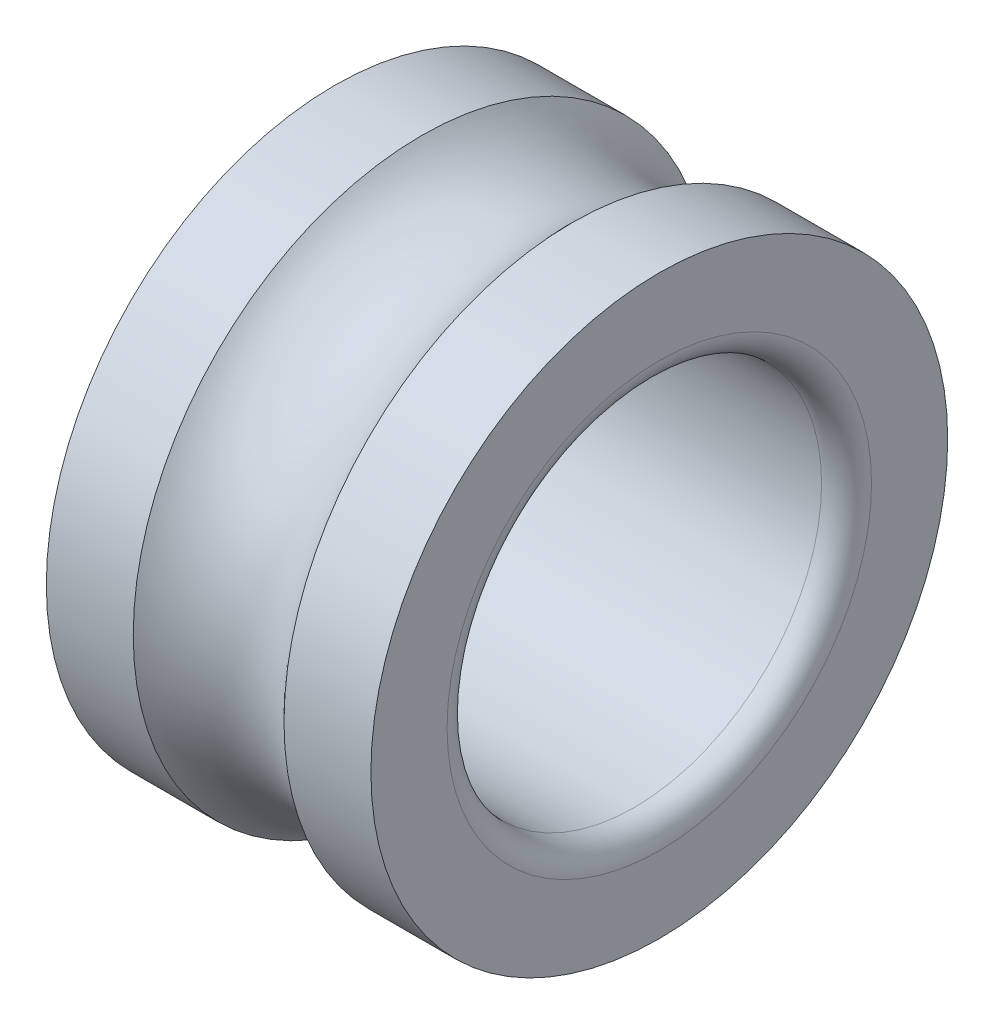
ISO-10303-21;
HEADER;
FILE_DESCRIPTION(('STEP AP214'),'2;1');
FILE_NAME('part.step','',(''),(''),'','','');
FILE_SCHEMA(('AUTOMOTIVE_DESIGN { 1 0 10303 214 1 1 1 1 }'));
ENDSEC;
DATA;
#1=APPLICATION_CONTEXT('core data for automotive mechanical design processes');
#2=APPLICATION_PROTOCOL_DEFINITION('international standard','automotive_design',2000,#1);
#3=PRODUCT_CONTEXT('',#1,'mechanical');
#4=PRODUCT('Part','Part','',(#3));
#5=PRODUCT_RELATED_PRODUCT_CATEGORY('part','',(#4));
#6=PRODUCT_DEFINITION_FORMATION('','',#4);
#7=PRODUCT_DEFINITION_CONTEXT('part definition',#1,'design');
#8=PRODUCT_DEFINITION('design','',#6,#7);
#9=PRODUCT_DEFINITION_SHAPE('','',#8);
#10=(LENGTH_UNIT() NAMED_UNIT(*) SI_UNIT(.MILLI.,.METRE.));
#11=(NAMED_UNIT(*) PLANE_ANGLE_UNIT() SI_UNIT($,.RADIAN.));
#12=(NAMED_UNIT(*) SI_UNIT($,.STERADIAN.) SOLID_ANGLE_UNIT());
#13=UNCERTAINTY_MEASURE_WITH_UNIT(LENGTH_MEASURE(1.E-05),#10,'distance_accuracy_value','');
#14=(GEOMETRIC_REPRESENTATION_CONTEXT(3) GLOBAL_UNCERTAINTY_ASSIGNED_CONTEXT((#13)) GLOBAL_UNIT_ASSIGNED_CONTEXT((#10,
#11,#12)) REPRESENTATION_CONTEXT('',''));
#15=CARTESIAN_POINT('',(0.,0.,0.));
#16=DIRECTION('',(0.,0.,1.));
#17=DIRECTION('',(1.,0.,0.));
#18=AXIS2_PLACEMENT_3D('',#15,#16,#17);
#19=CARTESIAN_POINT('',(1.,0.,0.));
#20=DIRECTION('',(-1.,0.,0.));
#21=DIRECTION('',(0.,-1.,0.));
#22=AXIS2_PLACEMENT_3D('',#19,#20,#21);
#23=TOROIDAL_SURFACE('',#22,8.5,1.);
#24=CARTESIAN_POINT('',(1.,0.,0.));
#25=DIRECTION('',(-1.,0.,0.));
#26=DIRECTION('',(0.,-1.,0.));
#27=AXIS2_PLACEMENT_3D('',#24,#25,#26);
#28=CIRCLE('',#27,7.5);
#29=CARTESIAN_POINT('',(1.,-7.5,0.));
#30=VERTEX_POINT('',#29);
#31=EDGE_CURVE('E10',#30,#30,#28,.T.);
#32=ORIENTED_EDGE('',*,*,#31,.F.);
#33=EDGE_LOOP('',(#32));
#34=FACE_BOUND('',#33,.T.);
#35=CARTESIAN_POINT('',(0.,0.,0.));
#36=DIRECTION('',(-1.,0.,0.));
#37=DIRECTION('',(0.,-1.,0.));
#38=AXIS2_PLACEMENT_3D('',#35,#36,#37);
#39=CIRCLE('',#38,8.5);
#40=CARTESIAN_POINT('',(0.,-8.5,0.));
#41=VERTEX_POINT('',#40);
#42=EDGE_CURVE('E58',#41,#41,#39,.T.);
#43=ORIENTED_EDGE('',*,*,#42,.T.);
#44=EDGE_LOOP('',(#43));
#45=FACE_BOUND('',#44,.T.);
#46=ADVANCED_FACE('F30',(#34,#45),#23,.T.);
#47=CARTESIAN_POINT('',(0.,0.,0.));
#48=DIRECTION('',(-1.,0.,0.));
#49=DIRECTION('',(0.,-1.,0.));
#50=AXIS2_PLACEMENT_3D('',#47,#48,#49);
#51=CYLINDRICAL_SURFACE('',#50,7.5);
#52=CARTESIAN_POINT('',(12.,0.,0.));
#53=DIRECTION('',(-1.,0.,0.));
#54=DIRECTION('',(0.,-1.,0.));
#55=AXIS2_PLACEMENT_3D('',#52,#53,#54);
#56=CIRCLE('',#55,7.50000000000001);
#57=CARTESIAN_POINT('',(12.,-7.5,0.));
#58=VERTEX_POINT('',#57);
#59=EDGE_CURVE('E36',#58,#58,#56,.T.);
#60=CARTESIAN_POINT('',(12.,-7.5,0.));
#61=CARTESIAN_POINT('',(11.8854166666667,-7.5,0.));
#62=CARTESIAN_POINT('',(11.7708333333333,-7.5,0.));
#63=CARTESIAN_POINT('',(11.5416666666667,-7.5,0.));
#64=CARTESIAN_POINT('',(11.4270833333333,-7.5,0.));
#65=CARTESIAN_POINT('',(11.1979166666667,-7.5,0.));
#66=CARTESIAN_POINT('',(11.0833333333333,-7.5,0.));
#67=CARTESIAN_POINT('',(10.8541666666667,-7.5,0.));
#68=CARTESIAN_POINT('',(10.7395833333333,-7.5,0.));
#69=CARTESIAN_POINT('',(10.5104166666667,-7.5,0.));
#70=CARTESIAN_POINT('',(10.3958333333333,-7.5,0.));
#71=CARTESIAN_POINT('',(10.1666666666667,-7.5,0.));
#72=CARTESIAN_POINT('',(10.0520833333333,-7.5,0.));
#73=CARTESIAN_POINT('',(9.82291666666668,-7.5,0.));
#74=CARTESIAN_POINT('',(9.70833333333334,-7.5,0.));
#75=CARTESIAN_POINT('',(9.47916666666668,-7.5,0.));
#76=CARTESIAN_POINT('',(9.36458333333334,-7.5,0.));
#77=CARTESIAN_POINT('',(9.13541666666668,-7.5,0.));
#78=CARTESIAN_POINT('',(9.02083333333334,-7.5,0.));
#79=CARTESIAN_POINT('',(8.79166666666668,-7.5,0.));
#80=CARTESIAN_POINT('',(8.67708333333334,-7.5,0.));
#81=CARTESIAN_POINT('',(8.44791666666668,-7.5,0.));
#82=CARTESIAN_POINT('',(8.33333333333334,-7.5,0.));
#83=CARTESIAN_POINT('',(8.10416666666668,-7.5,0.));
#84=CARTESIAN_POINT('',(7.98958333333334,-7.5,0.));
#85=CARTESIAN_POINT('',(7.76041666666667,-7.5,0.));
#86=CARTESIAN_POINT('',(7.64583333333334,-7.5,0.));
#87=CARTESIAN_POINT('',(7.41666666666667,-7.5,0.));
#88=CARTESIAN_POINT('',(7.30208333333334,-7.5,0.));
#89=CARTESIAN_POINT('',(7.07291666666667,-7.5,0.));
#90=CARTESIAN_POINT('',(6.95833333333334,-7.5,0.));
#91=CARTESIAN_POINT('',(6.72916666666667,-7.5,0.));
#92=CARTESIAN_POINT('',(6.61458333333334,-7.5,0.));
#93=CARTESIAN_POINT('',(6.38541666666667,-7.5,0.));
#94=CARTESIAN_POINT('',(6.27083333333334,-7.5,0.));
#95=CARTESIAN_POINT('',(6.04166666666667,-7.5,0.));
#96=CARTESIAN_POINT('',(5.92708333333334,-7.5,0.));
#97=CARTESIAN_POINT('',(5.69791666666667,-7.5,0.));
#98=CARTESIAN_POINT('',(5.58333333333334,-7.5,0.));
#99=CARTESIAN_POINT('',(5.35416666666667,-7.5,0.));
#100=CARTESIAN_POINT('',(5.23958333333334,-7.5,0.));
#101=CARTESIAN_POINT('',(5.01041666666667,-7.5,0.));
#102=CARTESIAN_POINT('',(4.89583333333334,-7.5,0.));
#103=CARTESIAN_POINT('',(4.66666666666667,-7.5,0.));
#104=CARTESIAN_POINT('',(4.55208333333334,-7.5,0.));
#105=CARTESIAN_POINT('',(4.32291666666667,-7.5,0.));
#106=CARTESIAN_POINT('',(4.20833333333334,-7.5,0.));
#107=CARTESIAN_POINT('',(3.97916666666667,-7.5,0.));
#108=CARTESIAN_POINT('',(3.86458333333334,-7.5,0.));
#109=CARTESIAN_POINT('',(3.63541666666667,-7.5,0.));
#110=CARTESIAN_POINT('',(3.52083333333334,-7.5,0.));
#111=CARTESIAN_POINT('',(3.29166666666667,-7.5,0.));
#112=CARTESIAN_POINT('',(3.17708333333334,-7.5,0.));
#113=CARTESIAN_POINT('',(2.94791666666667,-7.5,0.));
#114=CARTESIAN_POINT('',(2.83333333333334,-7.5,0.));
#115=CARTESIAN_POINT('',(2.60416666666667,-7.5,0.));
#116=CARTESIAN_POINT('',(2.48958333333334,-7.5,0.));
#117=CARTESIAN_POINT('',(2.26041666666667,-7.5,0.));
#118=CARTESIAN_POINT('',(2.14583333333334,-7.5,0.));
#119=CARTESIAN_POINT('',(1.91666666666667,-7.5,0.));
#120=CARTESIAN_POINT('',(1.80208333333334,-7.5,0.));
#121=CARTESIAN_POINT('',(1.57291666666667,-7.5,0.));
#122=CARTESIAN_POINT('',(1.45833333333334,-7.5,0.));
#123=CARTESIAN_POINT('',(1.22916666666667,-7.5,0.));
#124=CARTESIAN_POINT('',(1.11458333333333,-7.5,0.));
#125=CARTESIAN_POINT('',(1.,-7.5,0.));
#126=B_SPLINE_CURVE_WITH_KNOTS('',3,(#60,#61,#62,#63,#64,#65,#66,#67,#68,#69,#70,#71,#72,#73,
#74,#75,#76,#77,#78,#79,#80,#81,#82,#83,#84,#85,#86,#87,#88,#89,#90,#91,#92,#93,#94,#95,#96,#97,
#98,#99,#100,#101,#102,#103,#104,#105,#106,#107,#108,#109,#110,#111,#112,#113,#114,#115,#116,
#117,#118,#119,#120,#121,#122,#123,#124,#125),.UNSPECIFIED.,.F.,.F.,(4,2,2,2,2,2,2,2,2,2,2,2,2,
2,2,2,2,2,2,2,2,2,2,2,2,2,2,2,2,2,2,2,4),(0.,0.343749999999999,0.687499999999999,1.03125,1.375,
1.71875,2.0625,2.40625,2.75,3.09375,3.4375,3.78125,4.125,4.46875,4.81250000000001,
5.15625000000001,5.50000000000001,5.84375000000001,6.18750000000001,6.53125000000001,
6.87500000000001,7.21875000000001,7.56250000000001,7.90625000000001,8.25000000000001,
8.59375000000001,8.93750000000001,9.28125000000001,9.62500000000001,9.96875000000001,10.3125,
10.65625,11.),.UNSPECIFIED.);
#127=EDGE_CURVE('BSEAM95',#58,#30,#126,.T.);
#128=ORIENTED_EDGE('',*,*,#59,.F.);
#129=ORIENTED_EDGE('',*,*,#31,.T.);
#130=ORIENTED_EDGE('',*,*,#127,.T.);
#131=ORIENTED_EDGE('',*,*,#127,.F.);
#132=EDGE_LOOP('',(#128,#130,#129,#131));
#133=FACE_BOUND('',#132,.T.);
#134=ADVANCED_FACE('F95',(#133),#51,.F.);
#135=CARTESIAN_POINT('',(12.,0.,0.));
#136=DIRECTION('',(-1.,0.,0.));
#137=DIRECTION('',(0.,-1.,0.));
#138=AXIS2_PLACEMENT_3D('',#135,#136,#137);
#139=TOROIDAL_SURFACE('',#138,8.50000000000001,1.);
#140=CARTESIAN_POINT('',(13.,0.,0.));
#141=DIRECTION('',(-1.,0.,0.));
#142=DIRECTION('',(0.,-1.,0.));
#143=AXIS2_PLACEMENT_3D('',#140,#141,#142);
#144=CIRCLE('',#143,8.50000000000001);
#145=CARTESIAN_POINT('',(13.,-8.5,0.));
#146=VERTEX_POINT('',#145);
#147=EDGE_CURVE('E40',#146,#146,#144,.T.);
#148=ORIENTED_EDGE('',*,*,#147,.F.);
#149=EDGE_LOOP('',(#148));
#150=FACE_BOUND('',#149,.T.);
#151=ORIENTED_EDGE('',*,*,#59,.T.);
#152=EDGE_LOOP('',(#151));
#153=FACE_BOUND('',#152,.T.);
#154=ADVANCED_FACE('F90',(#150,#153),#139,.T.);
#155=CARTESIAN_POINT('',(13.,11.55,0.));
#156=DIRECTION('',(-1.,0.,0.));
#157=DIRECTION('',(0.,-1.,0.));
#158=AXIS2_PLACEMENT_3D('',#155,#156,#157);
#159=PLANE('',#158);
#160=CARTESIAN_POINT('',(13.,0.,0.));
#161=DIRECTION('',(-1.,0.,0.));
#162=DIRECTION('',(0.,-1.,0.));
#163=AXIS2_PLACEMENT_3D('',#160,#161,#162);
#164=CIRCLE('',#163,11.55);
#165=CARTESIAN_POINT('',(13.,-11.55,0.));
#166=VERTEX_POINT('',#165);
#167=EDGE_CURVE('E44',#166,#166,#164,.T.);
#168=ORIENTED_EDGE('',*,*,#167,.F.);
#169=EDGE_LOOP('',(#168));
#170=FACE_BOUND('',#169,.T.);
#171=ORIENTED_EDGE('',*,*,#147,.T.);
#172=EDGE_LOOP('',(#171));
#173=FACE_BOUND('',#172,.T.);
#174=ADVANCED_FACE('F84',(#170,#173),#159,.F.);
#175=CARTESIAN_POINT('',(0.,0.,0.));
#176=DIRECTION('',(-1.,0.,0.));
#177=DIRECTION('',(0.,-1.,0.));
#178=AXIS2_PLACEMENT_3D('',#175,#176,#177);
#179=CYLINDRICAL_SURFACE('',#178,11.55);
#180=CARTESIAN_POINT('',(9.51869176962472,0.,0.));
#181=DIRECTION('',(-1.,0.,0.));
#182=DIRECTION('',(0.,-1.,0.));
#183=AXIS2_PLACEMENT_3D('',#180,#181,#182);
#184=CIRCLE('',#183,11.55);
#185=CARTESIAN_POINT('',(9.51869176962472,-11.55,0.));
#186=VERTEX_POINT('',#185);
#187=EDGE_CURVE('E49',#186,#186,#184,.T.);
#188=CARTESIAN_POINT('',(9.51869176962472,-11.55,0.));
#189=CARTESIAN_POINT('',(9.55495539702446,-11.55,0.));
#190=CARTESIAN_POINT('',(9.59121902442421,-11.55,0.));
#191=CARTESIAN_POINT('',(9.66374627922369,-11.55,0.));
#192=CARTESIAN_POINT('',(9.70000990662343,-11.55,0.));
#193=CARTESIAN_POINT('',(9.77253716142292,-11.55,0.));
#194=CARTESIAN_POINT('',(9.80880078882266,-11.55,0.));
#195=CARTESIAN_POINT('',(9.88132804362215,-11.55,0.));
#196=CARTESIAN_POINT('',(9.91759167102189,-11.55,0.));
#197=CARTESIAN_POINT('',(9.99011892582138,-11.55,0.));
#198=CARTESIAN_POINT('',(10.0263825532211,-11.55,0.));
#199=CARTESIAN_POINT('',(10.0989098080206,-11.55,0.));
#200=CARTESIAN_POINT('',(10.1351734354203,-11.55,0.));
#201=CARTESIAN_POINT('',(10.2077006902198,-11.55,0.));
#202=CARTESIAN_POINT('',(10.2439643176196,-11.55,0.));
#203=CARTESIAN_POINT('',(10.3164915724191,-11.55,0.));
#204=CARTESIAN_POINT('',(10.3527551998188,-11.55,0.));
#205=CARTESIAN_POINT('',(10.4252824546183,-11.55,0.));
#206=CARTESIAN_POINT('',(10.461546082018,-11.55,0.));
#207=CARTESIAN_POINT('',(10.5340733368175,-11.55,0.));
#208=CARTESIAN_POINT('',(10.5703369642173,-11.55,0.));
#209=CARTESIAN_POINT('',(10.6428642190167,-11.55,0.));
#210=CARTESIAN_POINT('',(10.6791278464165,-11.55,0.));
#211=CARTESIAN_POINT('',(10.751655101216,-11.55,0.));
#212=CARTESIAN_POINT('',(10.7879187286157,-11.55,0.));
#213=CARTESIAN_POINT('',(10.8604459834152,-11.55,0.));
#214=CARTESIAN_POINT('',(10.8967096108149,-11.55,0.));
#215=CARTESIAN_POINT('',(10.9692368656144,-11.55,0.));
#216=CARTESIAN_POINT('',(11.0055004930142,-11.55,0.));
#217=CARTESIAN_POINT('',(11.0780277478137,-11.55,0.));
#218=CARTESIAN_POINT('',(11.1142913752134,-11.55,0.));
#219=CARTESIAN_POINT('',(11.1868186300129,-11.55,0.));
#220=CARTESIAN_POINT('',(11.2230822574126,-11.55,0.));
#221=CARTESIAN_POINT('',(11.2956095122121,-11.55,0.));
#222=CARTESIAN_POINT('',(11.3318731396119,-11.55,0.));
#223=CARTESIAN_POINT('',(11.4044003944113,-11.55,0.));
#224=CARTESIAN_POINT('',(11.4406640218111,-11.55,0.));
#225=CARTESIAN_POINT('',(11.5131912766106,-11.55,0.));
#226=CARTESIAN_POINT('',(11.5494549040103,-11.55,0.));
#227=CARTESIAN_POINT('',(11.6219821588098,-11.55,0.));
#228=CARTESIAN_POINT('',(11.6582457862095,-11.55,0.));
#229=CARTESIAN_POINT('',(11.730773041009,-11.55,0.));
#230=CARTESIAN_POINT('',(11.7670366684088,-11.55,0.));
#231=CARTESIAN_POINT('',(11.8395639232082,-11.55,0.));
#232=CARTESIAN_POINT('',(11.875827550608,-11.55,0.));
#233=CARTESIAN_POINT('',(11.9483548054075,-11.55,0.));
#234=CARTESIAN_POINT('',(11.9846184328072,-11.55,0.));
#235=CARTESIAN_POINT('',(12.0571456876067,-11.55,0.));
#236=CARTESIAN_POINT('',(12.0934093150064,-11.55,0.));
#237=CARTESIAN_POINT('',(12.1659365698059,-11.55,0.));
#238=CARTESIAN_POINT('',(12.2022001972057,-11.55,0.));
#239=CARTESIAN_POINT('',(12.2747274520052,-11.55,0.));
#240=CARTESIAN_POINT('',(12.3109910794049,-11.55,0.));
#241=CARTESIAN_POINT('',(12.3835183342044,-11.55,0.));
#242=CARTESIAN_POINT('',(12.4197819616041,-11.55,0.));
#243=CARTESIAN_POINT('',(12.4923092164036,-11.55,0.));
#244=CARTESIAN_POINT('',(12.5285728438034,-11.55,0.));
#245=CARTESIAN_POINT('',(12.6011000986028,-11.55,0.));
#246=CARTESIAN_POINT('',(12.6373637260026,-11.55,0.));
#247=CARTESIAN_POINT('',(12.7098909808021,-11.55,0.));
#248=CARTESIAN_POINT('',(12.7461546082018,-11.55,0.));
#249=CARTESIAN_POINT('',(12.8186818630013,-11.55,0.));
#250=CARTESIAN_POINT('',(12.854945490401,-11.55,0.));
#251=CARTESIAN_POINT('',(12.9274727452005,-11.55,0.));
#252=CARTESIAN_POINT('',(12.9637363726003,-11.55,0.));
#253=CARTESIAN_POINT('',(13.,-11.55,0.));
#254=B_SPLINE_CURVE_WITH_KNOTS('',3,(#188,#189,#190,#191,#192,#193,#194,#195,#196,#197,#198,
#199,#200,#201,#202,#203,#204,#205,#206,#207,#208,#209,#210,#211,#212,#213,#214,#215,#216,#217,
#218,#219,#220,#221,#222,#223,#224,#225,#226,#227,#228,#229,#230,#231,#232,#233,#234,#235,#236,
#237,#238,#239,#240,#241,#242,#243,#244,#245,#246,#247,#248,#249,#250,#251,#252,#253),
.UNSPECIFIED.,.F.,.F.,(4,2,2,2,2,2,2,2,2,2,2,2,2,2,2,2,2,2,2,2,2,2,2,2,2,2,2,2,2,2,2,2,4),(0.,
0.108790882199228,0.217581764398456,0.326372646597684,0.435163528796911,0.543954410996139,
0.652745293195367,0.761536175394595,0.870327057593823,0.979117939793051,1.08790882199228,
1.19669970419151,1.30549058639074,1.41428146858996,1.52307235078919,1.63186323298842,
1.74065411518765,1.84944499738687,1.9582358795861,2.06702676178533,2.17581764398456,
2.28460852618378,2.39339940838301,2.50219029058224,2.61098117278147,2.7197720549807,
2.82856293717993,2.93735381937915,3.04614470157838,3.15493558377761,3.26372646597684,
3.37251734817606,3.48130823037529),.UNSPECIFIED.);
#255=EDGE_CURVE('BSEAM78',#186,#166,#254,.T.);
#256=ORIENTED_EDGE('',*,*,#187,.F.);
#257=ORIENTED_EDGE('',*,*,#167,.T.);
#258=ORIENTED_EDGE('',*,*,#255,.T.);
#259=ORIENTED_EDGE('',*,*,#255,.F.);
#260=EDGE_LOOP('',(#256,#258,#257,#259));
#261=FACE_BOUND('',#260,.T.);
#262=ADVANCED_FACE('F78',(#261),#179,.T.);
#263=CARTESIAN_POINT('',(6.50000000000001,0.,0.));
#264=DIRECTION('',(-1.,0.,0.));
#265=DIRECTION('',(0.,-1.,0.));
#266=AXIS2_PLACEMENT_3D('',#263,#264,#265);
#267=TOROIDAL_SURFACE('',#266,14.25,4.05);
#268=CARTESIAN_POINT('',(3.48130823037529,0.,0.));
#269=DIRECTION('',(-1.,0.,0.));
#270=DIRECTION('',(0.,-1.,0.));
#271=AXIS2_PLACEMENT_3D('',#268,#269,#270);
#272=CIRCLE('',#271,11.55);
#273=CARTESIAN_POINT('',(3.48130823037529,-11.55,0.));
#274=VERTEX_POINT('',#273);
#275=EDGE_CURVE('E52',#274,#274,#272,.T.);
#276=ORIENTED_EDGE('',*,*,#275,.F.);
#277=EDGE_LOOP('',(#276));
#278=FACE_BOUND('',#277,.T.);
#279=ORIENTED_EDGE('',*,*,#187,.T.);
#280=EDGE_LOOP('',(#279));
#281=FACE_BOUND('',#280,.T.);
#282=ADVANCED_FACE('F72',(#278,#281),#267,.F.);
#283=CARTESIAN_POINT('',(0.,0.,0.));
#284=DIRECTION('',(-1.,0.,0.));
#285=DIRECTION('',(0.,-1.,0.));
#286=AXIS2_PLACEMENT_3D('',#283,#284,#285);
#287=CYLINDRICAL_SURFACE('',#286,11.55);
#288=CARTESIAN_POINT('',(0.,0.,0.));
#289=DIRECTION('',(-1.,0.,0.));
#290=DIRECTION('',(0.,-1.,0.));
#291=AXIS2_PLACEMENT_3D('',#288,#289,#290);
#292=CIRCLE('',#291,11.55);
#293=CARTESIAN_POINT('',(0.,-11.55,0.));
#294=VERTEX_POINT('',#293);
#295=EDGE_CURVE('E55',#294,#294,#292,.T.);
#296=CARTESIAN_POINT('',(0.,-11.55,0.));
#297=CARTESIAN_POINT('',(0.036263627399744,-11.55,0.));
#298=CARTESIAN_POINT('',(0.0725272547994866,-11.55,0.));
#299=CARTESIAN_POINT('',(0.145054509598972,-11.55,0.));
#300=CARTESIAN_POINT('',(0.181318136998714,-11.55,0.));
#301=CARTESIAN_POINT('',(0.2538453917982,-11.55,0.));
#302=CARTESIAN_POINT('',(0.290109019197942,-11.55,0.));
#303=CARTESIAN_POINT('',(0.362636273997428,-11.55,0.));
#304=CARTESIAN_POINT('',(0.39889990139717,-11.55,0.));
#305=CARTESIAN_POINT('',(0.471427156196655,-11.55,0.));
#306=CARTESIAN_POINT('',(0.507690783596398,-11.55,0.));
#307=CARTESIAN_POINT('',(0.580218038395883,-11.55,0.));
#308=CARTESIAN_POINT('',(0.616481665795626,-11.55,0.));
#309=CARTESIAN_POINT('',(0.689008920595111,-11.55,0.));
#310=CARTESIAN_POINT('',(0.725272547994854,-11.55,0.));
#311=CARTESIAN_POINT('',(0.797799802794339,-11.55,0.));
#312=CARTESIAN_POINT('',(0.834063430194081,-11.55,0.));
#313=CARTESIAN_POINT('',(0.906590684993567,-11.55,0.));
#314=CARTESIAN_POINT('',(0.942854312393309,-11.55,0.));
#315=CARTESIAN_POINT('',(1.01538156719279,-11.55,0.));
#316=CARTESIAN_POINT('',(1.05164519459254,-11.55,0.));
#317=CARTESIAN_POINT('',(1.12417244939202,-11.55,0.));
#318=CARTESIAN_POINT('',(1.16043607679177,-11.55,0.));
#319=CARTESIAN_POINT('',(1.23296333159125,-11.55,0.));
#320=CARTESIAN_POINT('',(1.26922695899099,-11.55,0.));
#321=CARTESIAN_POINT('',(1.34175421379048,-11.55,0.));
#322=CARTESIAN_POINT('',(1.37801784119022,-11.55,0.));
#323=CARTESIAN_POINT('',(1.45054509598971,-11.55,0.));
#324=CARTESIAN_POINT('',(1.48680872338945,-11.55,0.));
#325=CARTESIAN_POINT('',(1.55933597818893,-11.55,0.));
#326=CARTESIAN_POINT('',(1.59559960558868,-11.55,0.));
#327=CARTESIAN_POINT('',(1.66812686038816,-11.55,0.));
#328=CARTESIAN_POINT('',(1.7043904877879,-11.55,0.));
#329=CARTESIAN_POINT('',(1.77691774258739,-11.55,0.));
#330=CARTESIAN_POINT('',(1.81318136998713,-11.55,0.));
#331=CARTESIAN_POINT('',(1.88570862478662,-11.55,0.));
#332=CARTESIAN_POINT('',(1.92197225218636,-11.55,0.));
#333=CARTESIAN_POINT('',(1.99449950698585,-11.55,0.));
#334=CARTESIAN_POINT('',(2.03076313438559,-11.55,0.));
#335=CARTESIAN_POINT('',(2.10329038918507,-11.55,0.));
#336=CARTESIAN_POINT('',(2.13955401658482,-11.55,0.));
#337=CARTESIAN_POINT('',(2.2120812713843,-11.55,0.));
#338=CARTESIAN_POINT('',(2.24834489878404,-11.55,0.));
#339=CARTESIAN_POINT('',(2.32087215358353,-11.55,0.));
#340=CARTESIAN_POINT('',(2.35713578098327,-11.55,0.));
#341=CARTESIAN_POINT('',(2.42966303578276,-11.55,0.));
#342=CARTESIAN_POINT('',(2.4659266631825,-11.55,0.));
#343=CARTESIAN_POINT('',(2.53845391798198,-11.55,0.));
#344=CARTESIAN_POINT('',(2.57471754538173,-11.55,0.));
#345=CARTESIAN_POINT('',(2.64724480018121,-11.55,0.));
#346=CARTESIAN_POINT('',(2.68350842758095,-11.55,0.));
#347=CARTESIAN_POINT('',(2.75603568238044,-11.55,0.));
#348=CARTESIAN_POINT('',(2.79229930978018,-11.55,0.));
#349=CARTESIAN_POINT('',(2.86482656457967,-11.55,0.));
#350=CARTESIAN_POINT('',(2.90109019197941,-11.55,0.));
#351=CARTESIAN_POINT('',(2.9736174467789,-11.55,0.));
#352=CARTESIAN_POINT('',(3.00988107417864,-11.55,0.));
#353=CARTESIAN_POINT('',(3.08240832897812,-11.55,0.));
#354=CARTESIAN_POINT('',(3.11867195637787,-11.55,0.));
#355=CARTESIAN_POINT('',(3.19119921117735,-11.55,0.));
#356=CARTESIAN_POINT('',(3.22746283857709,-11.55,0.));
#357=CARTESIAN_POINT('',(3.29999009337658,-11.55,0.));
#358=CARTESIAN_POINT('',(3.33625372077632,-11.55,0.));
#359=CARTESIAN_POINT('',(3.40878097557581,-11.55,0.));
#360=CARTESIAN_POINT('',(3.44504460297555,-11.55,0.));
#361=CARTESIAN_POINT('',(3.48130823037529,-11.55,0.));
#362=B_SPLINE_CURVE_WITH_KNOTS('',3,(#296,#297,#298,#299,#300,#301,#302,#303,#304,#305,#306,
#307,#308,#309,#310,#311,#312,#313,#314,#315,#316,#317,#318,#319,#320,#321,#322,#323,#324,#325,
#326,#327,#328,#329,#330,#331,#332,#333,#334,#335,#336,#337,#338,#339,#340,#341,#342,#343,#344,
#345,#346,#347,#348,#349,#350,#351,#352,#353,#354,#355,#356,#357,#358,#359,#360,#361),
.UNSPECIFIED.,.F.,.F.,(4,2,2,2,2,2,2,2,2,2,2,2,2,2,2,2,2,2,2,2,2,2,2,2,2,2,2,2,2,2,2,2,4),(0.,
0.108790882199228,0.217581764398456,0.326372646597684,0.435163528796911,0.543954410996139,
0.652745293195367,0.761536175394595,0.870327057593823,0.979117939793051,1.08790882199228,
1.19669970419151,1.30549058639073,1.41428146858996,1.52307235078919,1.63186323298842,
1.74065411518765,1.84944499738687,1.9582358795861,2.06702676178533,2.17581764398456,
2.28460852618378,2.39339940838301,2.50219029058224,2.61098117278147,2.7197720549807,
2.82856293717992,2.93735381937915,3.04614470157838,3.15493558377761,3.26372646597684,
3.37251734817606,3.48130823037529),.UNSPECIFIED.);
#363=EDGE_CURVE('BSEAM66',#294,#274,#362,.T.);
#364=ORIENTED_EDGE('',*,*,#295,.F.);
#365=ORIENTED_EDGE('',*,*,#275,.T.);
#366=ORIENTED_EDGE('',*,*,#363,.T.);
#367=ORIENTED_EDGE('',*,*,#363,.F.);
#368=EDGE_LOOP('',(#364,#366,#365,#367));
#369=FACE_BOUND('',#368,.T.);
#370=ADVANCED_FACE('F66',(#369),#287,.T.);
#371=CARTESIAN_POINT('',(0.,11.55,0.));
#372=DIRECTION('',(1.,0.,0.));
#373=DIRECTION('',(0.,1.,0.));
#374=AXIS2_PLACEMENT_3D('',#371,#372,#373);
#375=PLANE('',#374);
#376=ORIENTED_EDGE('',*,*,#42,.F.);
#377=EDGE_LOOP('',(#376));
#378=FACE_BOUND('',#377,.T.);
#379=ORIENTED_EDGE('',*,*,#295,.T.);
#380=EDGE_LOOP('',(#379));
#381=FACE_BOUND('',#380,.T.);
#382=ADVANCED_FACE('F63',(#378,#381),#375,.F.);
#383=CLOSED_SHELL('',(#46,#134,#154,#174,#262,#282,#370,#382));
#384=MANIFOLD_SOLID_BREP('B2',#383);
#385=ADVANCED_BREP_SHAPE_REPRESENTATION('',(#18,#384),#14);
#386=SHAPE_DEFINITION_REPRESENTATION(#9,#385);
ENDSEC;
END-ISO-10303-21;
